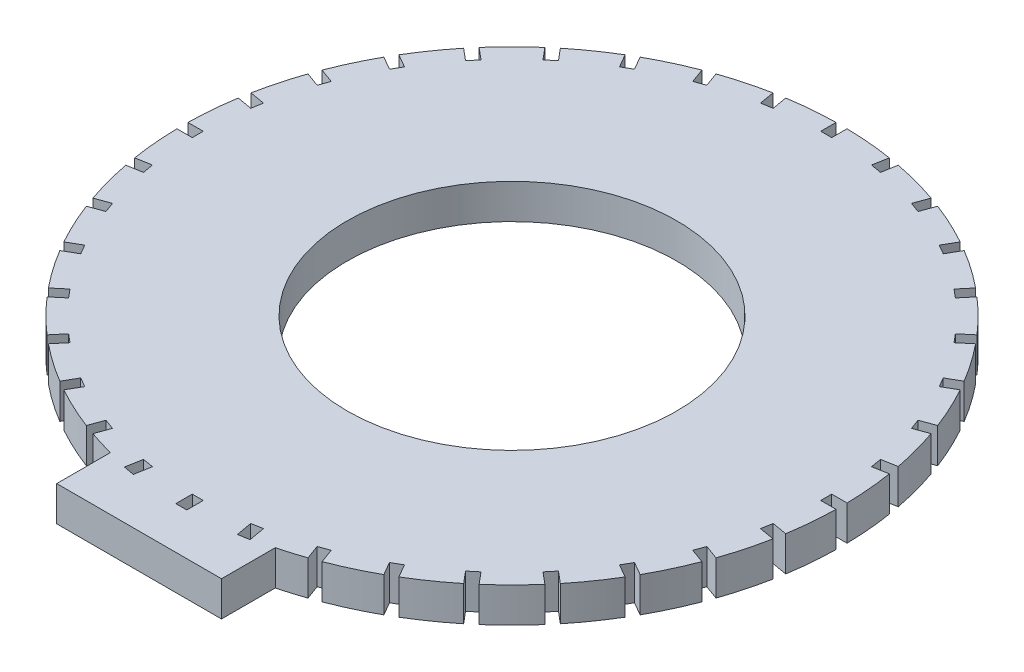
from build123d import *

# Parameters (mm, degrees)
SKETCH1_R           = 30
SKETCH1_R_2         = 15
BOSS_EXTRUDE1_DEPTH = 3.175
SKETCH2_W           = 1
SKETCH2_H           = 1.5
SKETCH2_W_2         = 1.5
SKETCH2_H_2         = 1
CUT_EXTRUDE1_DEPTH  = 3.175


with BuildPart() as part:
    # Sketch1 → Boss-Extrude1 (new body)
    # profile 1 of 3: a face of its own
    with BuildSketch(Plane(origin=(0, 0, 0), x_dir=(1, 0, 0), z_dir=(0, 1, 0))):
        Circle(SKETCH1_R)
        with Locations(Location((0, 0, 0), (0, 0, 270))):
            Circle(SKETCH1_R_2, mode=Mode.SUBTRACT)
    # profile 2 of 3: a face of its own
    with BuildSketch(Plane(origin=(0, 0, 0), x_dir=(1, 0, 0), z_dir=(0, 1, 0))):
        with BuildLine():
            Line((-7.5, -29.047375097), (-7.5, -33.94))
            Line((-7.5, -33.94), (0, -33.94))
            Line((0, -33.94), (0, -30))
            ThreePointArc((0, -30), (-3.780128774, -29.760890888), (-7.5, -29.047375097))
        make_face()
    # profile 3 of 3: a face of its own
    with BuildSketch(Plane(origin=(0, 0, 0), x_dir=(1, 0, 0), z_dir=(0, 1, 0))):
        with BuildLine():
            Line((0, -30), (0, -33.94))
            Line((0, -33.94), (7.5, -33.94))
            Line((7.5, -33.94), (7.5, -29.047375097))
            ThreePointArc((7.5, -29.047375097), (3.780128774, -29.760890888), (0, -30))
        make_face()
    extrude(amount=BOSS_EXTRUDE1_DEPTH)

    # Sketch2 → Cut-Extrude1 (cut)
    with BuildSketch(Plane(origin=(0, 3.175, 0), x_dir=(1, 0, 0), z_dir=(0, 1, 0))):
        Polygon((4.474016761, 28.252318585), (4.734489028, 29.729530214), (5.719296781, 29.555882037), (5.458824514, 28.078670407), align=None)
        with Locations((0, 29.35)):
            Rectangle(SKETCH2_W, SKETCH2_H)
        Polygon((9.312092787, 27.046190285), (9.825123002, 28.455729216), (10.764815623, 28.113709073), (10.251785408, 26.704170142), align=None)
        Polygon((13.867225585, 25.018262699), (14.617225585, 26.317300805), (15.483250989, 25.817300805), (14.733250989, 24.518262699), align=None)
        Polygon((18.001009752, 22.230153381), (18.965191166, 23.379220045), (19.731235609, 22.736432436), (18.767054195, 21.587365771), align=None)
        Polygon((21.587842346, 18.76657762), (22.73690901, 19.730759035), (23.37969662, 18.964714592), (22.230629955, 18.000533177), align=None)
        Polygon((24.518739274, 14.732774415), (25.81777738, 15.482774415), (26.31777738, 14.616749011), (25.018739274, 13.866749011), align=None)
        Polygon((26.704646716, 10.251308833), (28.114185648, 10.764339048), (28.456205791, 9.824646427), (27.04666686, 9.311616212), align=None)
        Polygon((28.079146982, 5.45834794), (29.556358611, 5.718820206), (29.730006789, 4.734012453), (28.252795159, 4.473540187), align=None)
        with Locations((29.350476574, -0.000476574)):
            Rectangle(SKETCH2_W_2, SKETCH2_H_2)
        Polygon((28.252795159, -4.474493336), (29.730006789, -4.734965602), (29.556358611, -5.719773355), (28.079146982, -5.459301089), align=None)
        Polygon((27.04666686, -9.312569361), (28.456205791, -9.825599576), (28.114185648, -10.765292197), (26.704646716, -10.252261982), align=None)
        Polygon((25.018739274, -13.86770216), (26.31777738, -14.61770216), (25.81777738, -15.483727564), (24.518739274, -14.733727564), align=None)
        Polygon((22.230629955, -18.001486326), (23.37969662, -18.965667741), (22.73690901, -19.731712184), (21.587842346, -18.767530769), align=None)
        Polygon((18.767054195, -21.58831892), (19.731235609, -22.737385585), (18.965191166, -23.380173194), (18.001009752, -22.23110653), align=None)
        Polygon((14.733250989, -24.519215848), (15.483250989, -25.818253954), (14.617225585, -26.318253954), (13.867225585, -25.019215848), align=None)
        Polygon((10.251785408, -26.705123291), (10.764815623, -28.114662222), (9.825123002, -28.456682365), (9.312092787, -27.047143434), align=None)
        Polygon((5.458824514, -28.079623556), (5.719296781, -29.556835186), (4.734489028, -29.730483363), (4.474016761, -28.253271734), align=None)
        with Locations((0, -29.350953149)):
            Rectangle(SKETCH2_W, SKETCH2_H)
        Polygon((-4.474016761, -28.253271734), (-4.734489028, -29.730483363), (-5.719296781, -29.556835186), (-5.458824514, -28.079623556), align=None)
        Polygon((-9.312092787, -27.047143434), (-9.825123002, -28.456682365), (-10.764815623, -28.114662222), (-10.251785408, -26.705123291), align=None)
        Polygon((-13.867225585, -25.019215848), (-14.617225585, -26.318253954), (-15.483250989, -25.818253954), (-14.733250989, -24.519215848), align=None)
        Polygon((-18.001009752, -22.23110653), (-18.965191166, -23.380173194), (-19.731235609, -22.737385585), (-18.767054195, -21.58831892), align=None)
        Polygon((-21.587842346, -18.767530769), (-22.73690901, -19.731712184), (-23.37969662, -18.965667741), (-22.230629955, -18.001486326), align=None)
        Polygon((-24.518739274, -14.733727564), (-25.81777738, -15.483727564), (-26.31777738, -14.61770216), (-25.018739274, -13.86770216), align=None)
        Polygon((-26.704646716, -10.252261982), (-28.114185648, -10.765292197), (-28.456205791, -9.825599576), (-27.04666686, -9.312569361), align=None)
        Polygon((-28.079146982, -5.459301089), (-29.556358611, -5.719773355), (-29.730006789, -4.734965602), (-28.252795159, -4.474493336), align=None)
        with Locations((-29.350476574, -0.000476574)):
            Rectangle(SKETCH2_W_2, SKETCH2_H_2)
        Polygon((-28.252795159, 4.473540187), (-29.730006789, 4.734012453), (-29.556358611, 5.718820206), (-28.079146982, 5.45834794), align=None)
        Polygon((-27.04666686, 9.311616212), (-28.456205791, 9.824646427), (-28.114185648, 10.764339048), (-26.704646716, 10.251308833), align=None)
        Polygon((-25.018739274, 13.866749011), (-26.31777738, 14.616749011), (-25.81777738, 15.482774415), (-24.518739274, 14.732774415), align=None)
        Polygon((-22.230629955, 18.000533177), (-23.37969662, 18.964714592), (-22.73690901, 19.730759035), (-21.587842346, 18.76657762), align=None)
        Polygon((-18.767054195, 21.587365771), (-19.731235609, 22.736432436), (-18.965191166, 23.379220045), (-18.001009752, 22.230153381), align=None)
        Polygon((-14.733250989, 24.518262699), (-15.483250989, 25.817300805), (-14.617225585, 26.317300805), (-13.867225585, 25.018262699), align=None)
        Polygon((-10.251785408, 26.704170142), (-10.764815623, 28.113709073), (-9.825123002, 28.455729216), (-9.312092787, 27.046190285), align=None)
        Polygon((-5.458824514, 28.078670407), (-5.719296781, 29.555882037), (-4.734489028, 29.729530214), (-4.474016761, 28.252318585), align=None)
    extrude(amount=-CUT_EXTRUDE1_DEPTH, mode=Mode.SUBTRACT)


solid = part.part
